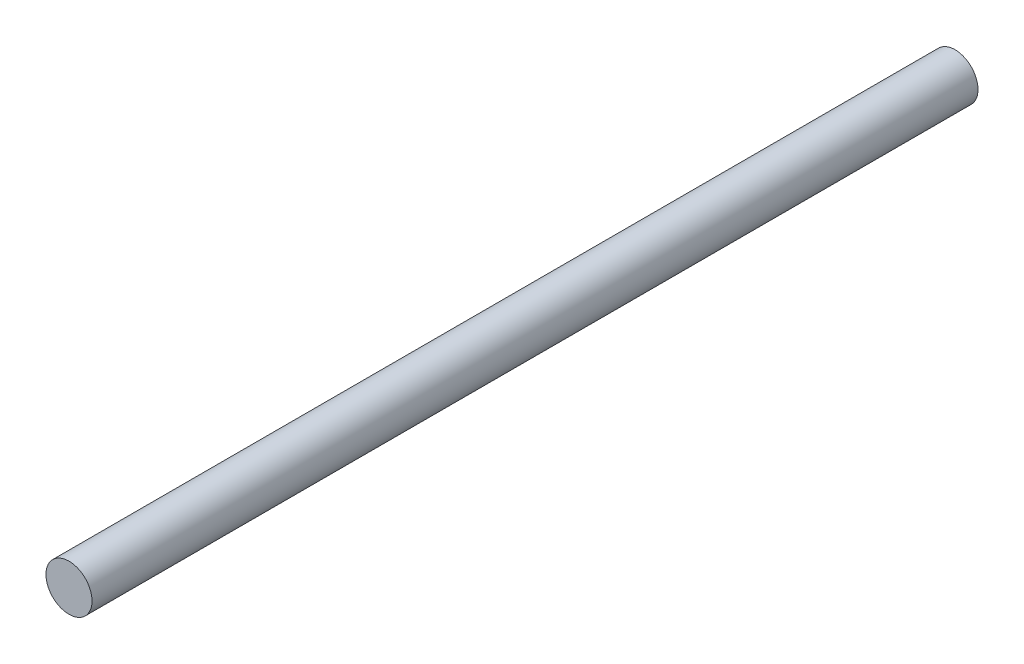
from build123d import *

# Parameters (mm, degrees)
SKETCH1_R          = 3.25
BASE_EXTRUDE_DEPTH = 125


with BuildPart() as part:
    # Sketch1 → Base-Extrude (new body)
    with BuildSketch(Plane.XY):
        with Locations((-86.996729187, -495.578834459)):
            Circle(SKETCH1_R)
    extrude(amount=BASE_EXTRUDE_DEPTH)


solid = part.part
